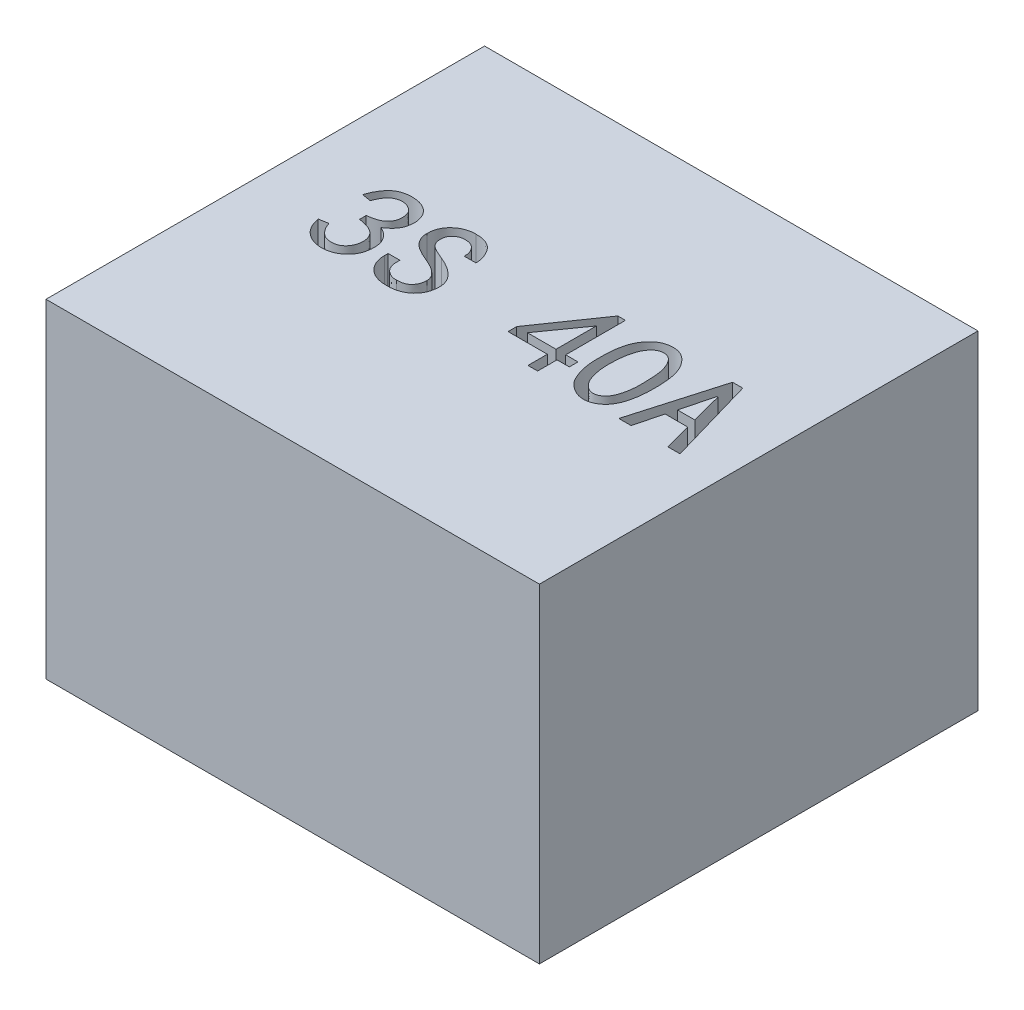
from build123d import *

# Parameters (mm, degrees)
SKETCH_1_W          = 72
SKETCH_1_H          = 64
EXTRUDE_1_DEPTH     = 48
CUT_EXTRUDE_1_DEPTH = 10


with BuildPart() as part:
    # Sketch 1 → Extrude 1 (new body)
    with BuildSketch(Plane(origin=(0, 0, 0), x_dir=(1, 0, 0), z_dir=(0, 1, 0))):
        Rectangle(SKETCH_1_W, SKETCH_1_H)
    extrude(amount=EXTRUDE_1_DEPTH)

    # Sketch 2 → Cut-Extrude 1 (cut)
    # profile 1 of 5: a face of its own
    with BuildSketch(Plane(origin=(0, 48, 0), x_dir=(1, 0, 0), z_dir=(0, 1, 0))):
        with BuildLine():
            add(Edge.make_bspline(
                [(11.771603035, 1.910613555), (11.778693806, 2.07064453), (11.792523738, 2.382770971), (11.832481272, 2.837886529), (11.880734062, 3.26861506), (11.943469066, 3.673639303), (12.021006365, 4.051611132), (12.108769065, 4.404511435), (12.21019269, 4.731352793), (12.359536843, 5.130521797), (12.583485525, 5.589960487), (12.903819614, 6.094916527), (13.276058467, 6.548836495), (13.628208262, 6.881438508), (13.933545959, 7.115525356), (14.17750496, 7.267510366), (14.43380695, 7.397370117), (14.703292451, 7.503273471), (14.985465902, 7.582161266), (15.279579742, 7.640403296), (15.58660466, 7.676432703), (15.902978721, 7.687151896), (16.221736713, 7.672143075), (16.534870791, 7.623248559), (16.83703971, 7.536448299), (17.128449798, 7.417285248), (17.408307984, 7.264175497), (17.678023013, 7.078348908), (17.934397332, 6.854999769), (18.180626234, 6.603197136), (18.410611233, 6.326068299), (18.621276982, 6.028961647), (18.811748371, 5.714941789), (18.979486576, 5.382285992), (19.129843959, 5.033927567), (19.255980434, 4.666763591), (19.360336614, 4.282285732), (19.475249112, 3.739143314), (19.576347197, 3.018678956), (19.647572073, 2.106846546), (19.663824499, 1.134577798), (19.639624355, 0.293764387), (19.594006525, -0.387488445), (19.542144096, -0.881609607), (19.47248386, -1.350550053), (19.391391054, -1.796592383), (19.289939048, -2.217364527), (19.169717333, -2.613317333), (19.039823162, -2.987037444), (18.886930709, -3.334596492), (18.720406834, -3.658946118), (18.530555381, -3.955931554), (18.324877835, -4.229564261), (18.097921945, -4.477675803), (17.8467308, -4.695268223), (17.580043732, -4.892841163), (17.290698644, -5.060997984), (16.986405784, -5.203695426), (16.673007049, -5.317264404), (16.354415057, -5.391285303), (16.036639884, -5.435280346), (15.717442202, -5.435441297), (15.398713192, -5.407688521), (15.081761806, -5.33468327), (14.762678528, -5.234308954), (14.450010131, -5.092360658), (14.14907418, -4.928914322), (13.86581322, -4.752996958), (13.607968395, -4.561573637), (13.373479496, -4.357149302), (13.159421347, -4.141440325), (12.968320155, -3.912398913), (12.80215945, -3.669390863), (12.616477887, -3.327389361), (12.41755363, -2.886248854), (12.211668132, -2.34286971), (12.043397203, -1.78642026), (11.93519557, -1.308234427), (11.863858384, -0.908195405), (11.824608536, -0.580262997), (11.79051414, -0.227256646), (11.769908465, 0.150905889), (11.756202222, 0.554552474), (11.750237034, 0.983970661), (11.756621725, 1.43911049), (11.7665211, 1.75067109), (11.771603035, 1.910613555)],
                knots=[0, 0, 0, 0, 1.18043416, 2.302333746, 3.366253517, 4.374302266, 5.321670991, 6.208995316, 7.053297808, 7.84229274, 9.348259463, 10.810477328, 12.240076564, 13.663562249, 14.3695339, 15.072606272, 15.778577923, 16.484387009, 17.202829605, 17.934942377, 18.692112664, 19.478485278, 20.265441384, 21.040673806, 21.808439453, 22.577161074, 23.356320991, 24.155029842, 24.986154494, 25.858111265, 26.748121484, 27.637306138, 28.540117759, 29.452135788, 30.380885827, 31.334339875, 32.310628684, 33.31521083, 35.42407972, 37.666773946, 40.052062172, 42.587025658, 43.863776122, 45.083322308, 46.247467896, 47.357025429, 48.423487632, 49.435172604, 50.405897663, 51.337337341, 52.231284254, 53.090220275, 53.931690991, 54.751583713, 55.562922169, 56.377338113, 57.194202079, 58.024663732, 58.851830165, 59.645552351, 60.431282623, 61.21044254, 61.99312915, 62.783838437, 63.60230231, 64.454612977, 65.309477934, 66.125301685, 66.909862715, 67.67340185, 68.415973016, 69.147238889, 69.868837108, 70.581506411, 72.0124375, 73.431838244, 74.861437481, 76.292961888, 77.042577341, 77.855187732, 78.726196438, 79.655959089, 80.645695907, 81.702690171, 82.820655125, 84, 84, 84, 84], degree=3))
        make_face()
        with BuildLine():
            add(Edge.make_bspline(
                [(13.335313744, 2.357388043), (13.318408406, 2.189265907), (13.285104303, 1.858059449), (13.257865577, 1.366721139), (13.250103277, 0.889291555), (13.25721143, 0.425577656), (13.284623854, -0.02351327), (13.331394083, -0.458850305), (13.398016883, -0.880127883), (13.479557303, -1.28622883), (13.57725396, -1.670662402), (13.693114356, -2.028205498), (13.824991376, -2.356253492), (13.97087835, -2.655300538), (14.131017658, -2.925703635), (14.308391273, -3.165927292), (14.498022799, -3.381081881), (14.705579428, -3.561893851), (14.918458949, -3.713736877), (15.136104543, -3.831717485), (15.35496655, -3.915318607), (15.575880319, -3.966435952), (15.798049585, -3.982757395), (16.021562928, -3.966947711), (16.244767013, -3.911767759), (16.466553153, -3.827196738), (16.680558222, -3.710715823), (16.883014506, -3.570064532), (17.069700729, -3.402096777), (17.240715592, -3.20861551), (17.395081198, -2.98842392), (17.536322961, -2.745286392), (17.660343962, -2.475170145), (17.806181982, -2.079671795), (17.953054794, -1.552973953), (18.083723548, -0.894820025), (18.160795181, -0.208451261), (18.181002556, 0.495762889), (18.167863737, 1.195486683), (18.152105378, 1.873325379), (18.114213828, 2.517825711), (18.068865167, 3.132269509), (17.991904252, 3.719400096), (17.850075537, 4.276142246), (17.651415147, 4.804005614), (17.447511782, 5.220699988), (17.252096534, 5.523173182), (17.098046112, 5.726123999), (16.926781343, 5.895713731), (16.74619258, 6.040289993), (16.552078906, 6.150358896), (16.346195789, 6.232693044), (16.128633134, 6.283716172), (15.902688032, 6.3088747), (15.675056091, 6.304476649), (15.451466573, 6.264522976), (15.234607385, 6.19464954), (15.023114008, 6.09517621), (14.821423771, 5.960541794), (14.626312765, 5.795761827), (14.439979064, 5.598061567), (14.256428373, 5.372806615), (14.088998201, 5.111241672), (13.934154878, 4.818239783), (13.79683767, 4.49003632), (13.67385591, 4.128530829), (13.563406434, 3.733742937), (13.470540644, 3.305435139), (13.393478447, 2.843266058), (13.35514392, 2.523039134), (13.335313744, 2.357388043)],
                knots=[0, 0, 0, 0, 1.378198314, 2.715098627, 4.012594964, 5.272602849, 6.497213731, 7.681415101, 8.842769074, 9.975170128, 11.059162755, 12.076494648, 13.038717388, 13.940857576, 14.788360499, 15.598271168, 16.373595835, 17.122768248, 17.838466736, 18.502782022, 19.136468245, 19.744060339, 20.345653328, 20.947246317, 21.563841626, 22.214212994, 22.87852828, 23.546305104, 24.220743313, 24.921956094, 25.648106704, 26.41081768, 27.212668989, 28.069279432, 29.84713992, 31.666334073, 33.537864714, 35.473745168, 37.408579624, 39.246547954, 41.003985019, 42.674193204, 44.272363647, 45.827394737, 47.348405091, 48.867584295, 49.599750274, 50.283750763, 50.94125936, 51.560811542, 52.165388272, 52.754418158, 53.363720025, 53.982318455, 54.604903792, 55.213928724, 55.828148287, 56.458765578, 57.113918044, 57.800421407, 58.537638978, 59.326979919, 60.167286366, 61.066273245, 62.027297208, 63.065989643, 64.179487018, 65.369443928, 66.639232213, 68, 68, 68, 68], degree=3))
        make_face(mode=Mode.SUBTRACT)
    # profile 2 of 5: a face of its own
    with BuildSketch(Plane(origin=(0, 48, 0), x_dir=(1, 0, 0), z_dir=(0, 1, 0))):
        with BuildLine():
            Line((-26.278690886, -1.997284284), (-24.938367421, -1.77389704))
            add(Edge.make_bspline(
                [(-24.938367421, -1.77389704), (-24.885534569, -1.930035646), (-24.781763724, -2.236712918), (-24.557541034, -2.660251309), (-24.289539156, -3.042405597), (-24.032421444, -3.328592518), (-23.800014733, -3.524023), (-23.616710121, -3.651907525), (-23.424065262, -3.761616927), (-23.216649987, -3.842110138), (-23.002110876, -3.911376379), (-22.774659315, -3.950255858), (-22.538669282, -3.972469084), (-22.295849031, -3.976289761), (-22.053834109, -3.954164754), (-21.820108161, -3.909933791), (-21.598370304, -3.844548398), (-21.389545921, -3.753235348), (-21.196583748, -3.634912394), (-21.012050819, -3.500355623), (-20.84304065, -3.338593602), (-20.691170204, -3.154573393), (-20.553813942, -2.957042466), (-20.435108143, -2.750638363), (-20.337048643, -2.536744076), (-20.263789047, -2.315273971), (-20.206811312, -2.087821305), (-20.175367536, -1.852949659), (-20.160289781, -1.611311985), (-20.170162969, -1.366002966), (-20.195140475, -1.123786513), (-20.246165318, -0.892271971), (-20.314803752, -0.675543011), (-20.40000178, -0.469524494), (-20.511002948, -0.281304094), (-20.638809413, -0.105252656), (-20.78614997, 0.056471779), (-20.956611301, 0.202959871), (-21.148457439, 0.338939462), (-21.365930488, 0.464508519), (-21.61208165, 0.574802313), (-21.881708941, 0.681125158), (-22.180325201, 0.770700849), (-22.504084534, 0.853100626), (-22.855622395, 0.925172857), (-23.099598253, 0.962114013), (-23.225731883, 0.981212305)],
                knots=[0, 0, 0, 0, 1.854799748, 3.643076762, 5.375778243, 7.105784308, 7.958514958, 8.791774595, 9.621744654, 10.44880128, 11.294076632, 12.157496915, 13.041787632, 13.96367637, 14.889223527, 15.774908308, 16.640004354, 17.48869958, 18.334228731, 19.185637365, 20.057465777, 20.961908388, 21.86984341, 22.765285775, 23.641349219, 24.5158806, 25.390105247, 26.279235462, 27.181837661, 28.114543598, 29.042174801, 29.921843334, 30.780091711, 31.601551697, 32.427634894, 33.235597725, 34.049381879, 34.886366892, 35.762920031, 36.695625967, 37.710569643, 38.799256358, 39.959035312, 41.220118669, 42.562822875, 44, 44, 44, 44], degree=3))
            Line((-23.225731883, 0.981212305), (-23.225731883, 1.949223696))
            add(Edge.make_bspline(
                [(-23.225731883, 1.949223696), (-23.099532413, 1.962109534), (-22.855244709, 1.987052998), (-22.504194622, 2.053123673), (-22.179084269, 2.127532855), (-21.881340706, 2.22207747), (-21.609970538, 2.332236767), (-21.363890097, 2.457406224), (-21.14613087, 2.602632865), (-20.95510352, 2.763098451), (-20.788057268, 2.937543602), (-20.647108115, 3.125934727), (-20.529583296, 3.326293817), (-20.437825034, 3.540345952), (-20.373122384, 3.76766651), (-20.326690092, 4.006531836), (-20.312985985, 4.25833777), (-20.317834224, 4.517527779), (-20.345570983, 4.774177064), (-20.404634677, 5.017395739), (-20.487789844, 5.242310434), (-20.593924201, 5.451234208), (-20.732653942, 5.637486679), (-20.892906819, 5.807109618), (-21.079737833, 5.956750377), (-21.288702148, 6.085270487), (-21.51235433, 6.190236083), (-21.741244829, 6.275701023), (-21.975358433, 6.326969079), (-22.211803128, 6.354789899), (-22.45251834, 6.359136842), (-22.696320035, 6.329115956), (-22.943957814, 6.276526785), (-23.193737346, 6.197607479), (-23.442229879, 6.086271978), (-23.675275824, 5.925488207), (-23.893205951, 5.723646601), (-24.103541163, 5.484522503), (-24.293035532, 5.197899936), (-24.476129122, 4.874256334), (-24.645030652, 4.508074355), (-24.739968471, 4.245478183), (-24.789442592, 4.108633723)],
                knots=[0, 0, 0, 0, 1.385117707, 2.68120955, 3.899080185, 5.026526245, 6.089471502, 7.095537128, 8.036926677, 8.942108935, 9.815771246, 10.669349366, 11.506404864, 12.347666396, 13.205663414, 14.084102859, 14.999917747, 15.954128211, 16.914501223, 17.813254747, 18.680661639, 19.529560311, 20.363114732, 21.208382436, 22.07252795, 22.96987783, 23.881720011, 24.767988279, 25.632833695, 26.492298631, 27.366018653, 28.255410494, 29.169296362, 30.128408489, 31.112431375, 32.1318401, 33.205217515, 34.351116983, 35.601710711, 36.950682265, 38.410935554, 40, 40, 40, 40], degree=3))
            Line((-24.789442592, 4.108633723), (-26.129766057, 4.332020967))
            add(Edge.make_bspline(
                [(-26.129766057, 4.332020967), (-26.051634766, 4.547691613), (-25.899388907, 4.967945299), (-25.614890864, 5.55888926), (-25.284711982, 6.091457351), (-24.975186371, 6.493404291), (-24.703319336, 6.78207131), (-24.477868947, 6.96815102), (-24.238879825, 7.137274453), (-23.980103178, 7.278773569), (-23.704608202, 7.399456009), (-23.411034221, 7.491777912), (-23.101227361, 7.563609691), (-22.778404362, 7.612350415), (-22.453117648, 7.638176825), (-22.133492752, 7.648675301), (-21.824192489, 7.632583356), (-21.524229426, 7.605210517), (-21.236042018, 7.551162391), (-20.957927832, 7.480405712), (-20.691630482, 7.38518776), (-20.434069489, 7.276489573), (-20.193409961, 7.14648725), (-19.96673192, 7.004116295), (-19.763875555, 6.838822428), (-19.573001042, 6.664091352), (-19.409134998, 6.465344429), (-19.257819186, 6.254568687), (-19.125880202, 6.026759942), (-19.016524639, 5.78299265), (-18.925183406, 5.530557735), (-18.856831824, 5.269121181), (-18.805836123, 5.003054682), (-18.781909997, 4.729676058), (-18.779109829, 4.452127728), (-18.798955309, 4.168172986), (-18.840890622, 3.878872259), (-18.902975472, 3.584961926), (-18.992322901, 3.291230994), (-19.120975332, 3.005558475), (-19.28449361, 2.729561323), (-19.482572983, 2.46283417), (-19.714900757, 2.205635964), (-19.984937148, 1.961196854), (-20.286155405, 1.721858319), (-20.506184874, 1.577054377), (-20.619547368, 1.502449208)],
                knots=[0, 0, 0, 0, 2.088435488, 4.069504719, 5.960900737, 7.786563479, 8.680771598, 9.566313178, 10.444341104, 11.343825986, 12.247587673, 13.179685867, 14.142420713, 15.141886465, 16.150152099, 17.113396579, 18.05212794, 18.969441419, 19.854666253, 20.719823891, 21.58047219, 22.428151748, 23.263500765, 24.069461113, 24.861911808, 25.643808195, 26.422154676, 27.202794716, 28.005617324, 28.815006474, 29.633397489, 30.44783822, 31.273903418, 32.097929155, 32.94366283, 33.799737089, 34.68784804, 35.604243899, 36.533818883, 37.478357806, 38.450549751, 39.450331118, 40.49965591, 41.60193164, 42.764479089, 44, 44, 44, 44], degree=3))
            add(Edge.make_bspline(
                [(-20.619547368, 1.502449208), (-20.453170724, 1.423706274), (-20.127451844, 1.269549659), (-19.691890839, 0.957676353), (-19.317982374, 0.589955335), (-19.059205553, 0.237992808), (-18.884333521, -0.068951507), (-18.780233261, -0.321239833), (-18.700649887, -0.590477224), (-18.643142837, -0.875669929), (-18.606643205, -1.178116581), (-18.597502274, -1.49813237), (-18.608179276, -1.836292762), (-18.64414784, -2.18546107), (-18.701648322, -2.535975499), (-18.793919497, -2.873466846), (-18.911913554, -3.194224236), (-19.059490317, -3.498838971), (-19.237858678, -3.784650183), (-19.44851622, -4.05107541), (-19.68207054, -4.304005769), (-19.947031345, -4.532663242), (-20.227752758, -4.740979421), (-20.522360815, -4.921449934), (-20.825550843, -5.073694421), (-21.138508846, -5.195781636), (-21.461008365, -5.287012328), (-21.792317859, -5.35002645), (-22.133600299, -5.386917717), (-22.480501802, -5.390848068), (-22.826504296, -5.370222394), (-23.163343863, -5.318493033), (-23.490018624, -5.249507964), (-23.803595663, -5.147360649), (-24.107659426, -5.025304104), (-24.396809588, -4.871781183), (-24.675844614, -4.696584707), (-24.941960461, -4.497027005), (-25.191142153, -4.270550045), (-25.417698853, -4.017916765), (-25.62373373, -3.742560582), (-25.798008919, -3.438238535), (-25.958654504, -3.11487042), (-26.08785895, -2.763502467), (-26.201030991, -2.390184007), (-26.252417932, -2.130205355), (-26.278690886, -1.997284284)],
                knots=[0, 0, 0, 0, 1.556863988, 3.047903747, 4.51274202, 5.983117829, 6.732724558, 7.500714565, 8.289161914, 9.10779992, 9.96267821, 10.866591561, 11.817204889, 12.826910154, 13.838355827, 14.822602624, 15.786048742, 16.729939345, 17.685039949, 18.633769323, 19.603521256, 20.596937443, 21.593797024, 22.562140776, 23.519904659, 24.464277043, 25.403497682, 26.355035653, 27.318261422, 28.307425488, 29.290655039, 30.251043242, 31.192037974, 32.115630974, 33.041191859, 33.964292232, 34.884727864, 35.830159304, 36.778345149, 37.732302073, 38.701115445, 39.685485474, 40.699027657, 41.756353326, 42.852875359, 44, 44, 44, 44], degree=3))
        make_face()
    # profile 3 of 5: a face of its own
    with BuildSketch(Plane(origin=(0, 48, 0), x_dir=(1, 0, 0), z_dir=(0, 1, 0))):
        with BuildLine():
            add(Edge.make_bspline(
                [(-8.854485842, -1.699434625), (-8.857548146, -1.838393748), (-8.863531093, -2.109883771), (-8.913708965, -2.507168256), (-8.998590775, -2.882262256), (-9.117688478, -3.235413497), (-9.269937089, -3.565694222), (-9.456440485, -3.874853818), (-9.677145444, -4.162043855), (-9.931631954, -4.423667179), (-10.213352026, -4.658806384), (-10.521454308, -4.86359581), (-10.853656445, -5.038648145), (-11.212184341, -5.17853468), (-11.593229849, -5.289391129), (-11.999678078, -5.365446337), (-12.429389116, -5.412986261), (-12.724564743, -5.419318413), (-12.875456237, -5.422555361)],
                knots=[0, 0, 0, 0, 1.076144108, 2.102505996, 3.095825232, 4.050645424, 4.984196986, 5.907479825, 6.841845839, 7.783590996, 8.729097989, 9.679099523, 10.644246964, 11.632062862, 12.655232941, 13.713869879, 14.831347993, 16, 16, 16, 16], degree=3))
            add(Edge.make_bspline(
                [(-12.875456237, -5.422555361), (-13.02638016, -5.419626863), (-13.320808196, -5.413913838), (-13.748547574, -5.36237924), (-14.152804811, -5.284596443), (-14.529918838, -5.167700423), (-14.88347007, -5.022884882), (-15.207846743, -4.8401103), (-15.512154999, -4.632307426), (-15.781796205, -4.384296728), (-16.029216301, -4.119468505), (-16.237467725, -3.829751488), (-16.419739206, -3.528585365), (-16.565171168, -3.208655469), (-16.683450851, -2.874359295), (-16.760899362, -2.52128176), (-16.81318986, -2.153287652), (-16.819004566, -1.901868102), (-16.821964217, -1.77389704)],
                knots=[0, 0, 0, 0, 1.196538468, 2.33425201, 3.412396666, 4.457161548, 5.460527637, 6.436390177, 7.405227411, 8.375846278, 9.335670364, 10.274835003, 11.200142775, 12.12337999, 13.057237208, 14.007039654, 14.985594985, 16, 16, 16, 16], degree=3))
            Line((-16.821964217, -1.77389704), (-16.821964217, -1.252660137))
            Line((-16.821964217, -1.252660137), (-15.109328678, -1.252660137))
            Line((-15.109328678, -1.252660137), (-15.109328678, -1.699434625))
            add(Edge.make_bspline(
                [(-15.109328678, -1.699434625), (-15.107023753, -1.789599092), (-15.102518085, -1.965852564), (-15.0729856, -2.221830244), (-15.020238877, -2.462078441), (-14.94627263, -2.684867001), (-14.851594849, -2.892419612), (-14.735300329, -3.082639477), (-14.599601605, -3.258722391), (-14.39090391, -3.464973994), (-14.099559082, -3.678213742), (-13.719090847, -3.872307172), (-13.30557923, -3.985095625), (-13.020448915, -4.000126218), (-12.875456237, -4.007769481)],
                knots=[0, 0, 0, 0, 0.899937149, 1.759196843, 2.567308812, 3.350717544, 4.097934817, 4.839099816, 5.571408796, 6.31103876, 7.760779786, 9.155922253, 10.553747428, 12, 12, 12, 12], degree=3))
            add(Edge.make_bspline(
                [(-12.875456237, -4.007769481), (-12.779805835, -4.0052048), (-12.593622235, -4.000212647), (-12.323819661, -3.974584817), (-12.073829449, -3.924184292), (-11.844286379, -3.856277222), (-11.633739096, -3.767287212), (-11.444567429, -3.657035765), (-11.27222156, -3.52934967), (-11.076965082, -3.329760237), (-10.871191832, -3.051825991), (-10.69605703, -2.678463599), (-10.586653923, -2.273695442), (-10.573739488, -1.992473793), (-10.567121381, -1.848359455)],
                knots=[0, 0, 0, 0, 0.962219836, 1.872961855, 2.721515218, 3.522926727, 4.276799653, 5.014164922, 5.72050659, 6.426545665, 7.815246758, 9.175842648, 10.55273742, 12, 12, 12, 12], degree=3))
            add(Edge.make_bspline(
                [(-10.567121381, -1.848359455), (-10.569403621, -1.786641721), (-10.573927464, -1.664305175), (-10.605565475, -1.481928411), (-10.657366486, -1.302992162), (-10.73302913, -1.128800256), (-10.828521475, -0.958137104), (-10.943927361, -0.791029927), (-11.08064743, -0.626890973), (-11.296445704, -0.408779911), (-11.61901421, -0.145971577), (-12.067637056, 0.151597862), (-12.592128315, 0.43263681), (-12.97338456, 0.597114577), (-13.173305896, 0.683362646)],
                knots=[0, 0, 0, 0, 0.578251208, 1.146206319, 1.729632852, 2.320140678, 2.921792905, 3.559846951, 4.220588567, 4.921185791, 6.432399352, 8.109791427, 9.960070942, 12, 12, 12, 12], degree=3))
            add(Edge.make_bspline(
                [(-13.173305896, 0.683362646), (-13.317087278, 0.73944283), (-13.596278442, 0.848337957), (-13.996896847, 1.022078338), (-14.366731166, 1.199937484), (-14.70347597, 1.385875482), (-15.01090152, 1.571738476), (-15.285456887, 1.765433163), (-15.528061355, 1.964257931), (-15.744122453, 2.16524286), (-15.926338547, 2.3785072), (-16.089348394, 2.595274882), (-16.22052107, 2.826659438), (-16.33225408, 3.063875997), (-16.4188269, 3.311494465), (-16.477710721, 3.568758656), (-16.519647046, 3.835160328), (-16.522610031, 4.016535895), (-16.524114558, 4.108633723)],
                knots=[0, 0, 0, 0, 1.442788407, 2.80157118, 4.081608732, 5.277882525, 6.396683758, 7.438774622, 8.41600694, 9.327939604, 10.193066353, 11.035393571, 11.859457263, 12.674643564, 13.484648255, 14.306018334, 15.139839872, 16, 16, 16, 16], degree=3))
            add(Edge.make_bspline(
                [(-16.524114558, 4.108633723), (-16.520981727, 4.235646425), (-16.514827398, 4.485158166), (-16.465071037, 4.850516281), (-16.379144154, 5.196940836), (-16.260459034, 5.524537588), (-16.107143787, 5.833086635), (-15.921836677, 6.123778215), (-15.702480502, 6.396484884), (-15.449363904, 6.644334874), (-15.174293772, 6.869065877), (-14.885372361, 7.069528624), (-14.580319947, 7.234843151), (-14.263415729, 7.370459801), (-13.93553282, 7.479745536), (-13.593088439, 7.552070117), (-13.23915095, 7.602366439), (-12.997905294, 7.606346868), (-12.875456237, 7.608367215)],
                knots=[0, 0, 0, 0, 1.07870255, 2.119071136, 3.124805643, 4.105581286, 5.072990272, 6.045680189, 7.028691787, 8.039235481, 9.049145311, 10.043383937, 11.021887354, 11.990902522, 12.968844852, 13.952259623, 14.960628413, 16, 16, 16, 16], degree=3))
            add(Edge.make_bspline(
                [(-12.875456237, 7.608367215), (-12.719976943, 7.604299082), (-12.418216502, 7.596403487), (-11.982616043, 7.546170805), (-11.580907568, 7.453894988), (-11.212489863, 7.328924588), (-10.877699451, 7.163780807), (-10.574787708, 6.966703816), (-10.309469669, 6.727427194), (-10.079476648, 6.456966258), (-9.882413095, 6.165856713), (-9.706471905, 5.868765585), (-9.556429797, 5.566376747), (-9.438415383, 5.255272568), (-9.344375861, 4.940049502), (-9.273463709, 4.618750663), (-9.235752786, 4.290644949), (-9.229785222, 4.070107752), (-9.226797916, 3.959708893)],
                knots=[0, 0, 0, 0, 1.282260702, 2.488662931, 3.608602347, 4.675455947, 5.689164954, 6.679473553, 7.645844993, 8.624331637, 9.600024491, 10.541331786, 11.470286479, 12.379766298, 13.281599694, 14.181168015, 15.089509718, 16, 16, 16, 16], degree=3))
            Line((-9.226797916, 3.959708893), (-10.939433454, 3.959708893))
            add(Edge.make_bspline(
                [(-10.939433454, 3.959708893), (-10.934055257, 4.093274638), (-10.923425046, 4.357272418), (-11.001735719, 4.747081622), (-11.155139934, 5.11574093), (-11.339609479, 5.400033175), (-11.519427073, 5.607946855), (-11.673155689, 5.74402313), (-11.838450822, 5.860294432), (-12.018882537, 5.956225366), (-12.21363673, 6.029527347), (-12.422665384, 6.082386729), (-12.644759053, 6.112433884), (-12.797226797, 6.116852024), (-12.875456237, 6.11911892)],
                knots=[0, 0, 0, 0, 1.460207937, 2.886156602, 4.313065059, 5.813047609, 6.57660706, 7.318406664, 8.055956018, 8.78576476, 9.550717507, 10.329856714, 11.143068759, 12, 12, 12, 12], degree=3))
            add(Edge.make_bspline(
                [(-12.875456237, 6.11911892), (-13.017598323, 6.114018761), (-13.288582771, 6.104295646), (-13.672070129, 6.011055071), (-14.010240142, 5.859241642), (-14.29666734, 5.644047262), (-14.52960251, 5.380517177), (-14.69601006, 5.068165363), (-14.793818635, 4.712892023), (-14.805439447, 4.462272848), (-14.81147902, 4.332020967)],
                knots=[0, 0, 0, 0, 1.145558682, 2.183931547, 3.163371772, 4.117557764, 5.053569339, 5.979736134, 6.950027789, 8, 8, 8, 8], degree=3))
            add(Edge.make_bspline(
                [(-14.81147902, 4.332020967), (-14.807228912, 4.223954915), (-14.79890279, 4.012249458), (-14.717868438, 3.707031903), (-14.590130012, 3.424445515), (-14.438277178, 3.20567614), (-14.273542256, 3.042372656), (-14.108413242, 2.912934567), (-13.902965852, 2.778680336), (-13.656748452, 2.638440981), (-13.36909845, 2.494326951), (-13.044195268, 2.338205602), (-12.675595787, 2.182813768), (-12.415967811, 2.078443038), (-12.279756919, 2.023686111)],
                knots=[0, 0, 0, 0, 1.054277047, 2.065368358, 3.062471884, 4.074520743, 4.646282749, 5.323992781, 6.121378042, 7.042966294, 8.091677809, 9.265162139, 10.56519814, 12, 12, 12, 12], degree=3))
            add(Edge.make_bspline(
                [(-12.279756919, 2.023686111), (-12.146931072, 1.967715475), (-11.886400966, 1.857932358), (-11.510294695, 1.678807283), (-11.158819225, 1.488379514), (-10.82907372, 1.293384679), (-10.524729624, 1.088371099), (-10.242780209, 0.875986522), (-9.983017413, 0.656010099), (-9.747657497, 0.426818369), (-9.538416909, 0.189967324), (-9.352816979, -0.052985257), (-9.202341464, -0.309231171), (-9.073532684, -0.569943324), (-8.977155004, -0.841608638), (-8.904510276, -1.118967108), (-8.862249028, -1.406723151), (-8.857098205, -1.600935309), (-8.854485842, -1.699434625)],
                knots=[0, 0, 0, 0, 1.286245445, 2.522894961, 3.715884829, 4.852742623, 5.94040206, 6.988895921, 8.001566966, 8.976237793, 9.917821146, 10.82027623, 11.699651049, 12.565605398, 13.411626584, 14.267259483, 15.121199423, 16, 16, 16, 16], degree=3))
        make_face()
    # profile 4 of 5: a face of its own
    with BuildSketch(Plane(origin=(0, 48, 0), x_dir=(1, 0, 0), z_dir=(0, 1, 0))):
        Polygon((7.527245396, -2.369596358), (1.793639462, -2.369596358), (1.793639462, -1.103735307), (7.825095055, 7.608367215), (8.942031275, 7.608367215), (8.942031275, -1.103735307), (10.729129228, -1.103735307), (10.729129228, -2.369596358), (8.942031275, -2.369596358), (8.942031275, -5.199168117), (7.527245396, -5.199168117), align=None)
        Polygon((7.527245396, -1.103735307), (7.527245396, 4.778795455), (3.357350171, -1.103735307), align=None, mode=Mode.SUBTRACT)
    # profile 5 of 5: a face of its own
    with BuildSketch(Plane(origin=(0, 48, 0), x_dir=(1, 0, 0), z_dir=(0, 1, 0))):
        Polygon((29.791507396, -5.273630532), (28.004409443, -5.273630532), (26.961935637, -1.327122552), (23.685589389, -1.327122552), (22.643115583, -5.273630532), (20.85601763, -5.273630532), (24.579138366, 7.608367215), (26.06838666, 7.608367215), align=None)
        Polygon((26.589623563, 0.087663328), (25.398224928, 4.629870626), (25.249300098, 4.629870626), (24.057901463, 0.087663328), align=None, mode=Mode.SUBTRACT)
    extrude(amount=-CUT_EXTRUDE_1_DEPTH, mode=Mode.SUBTRACT)


solid = part.part
